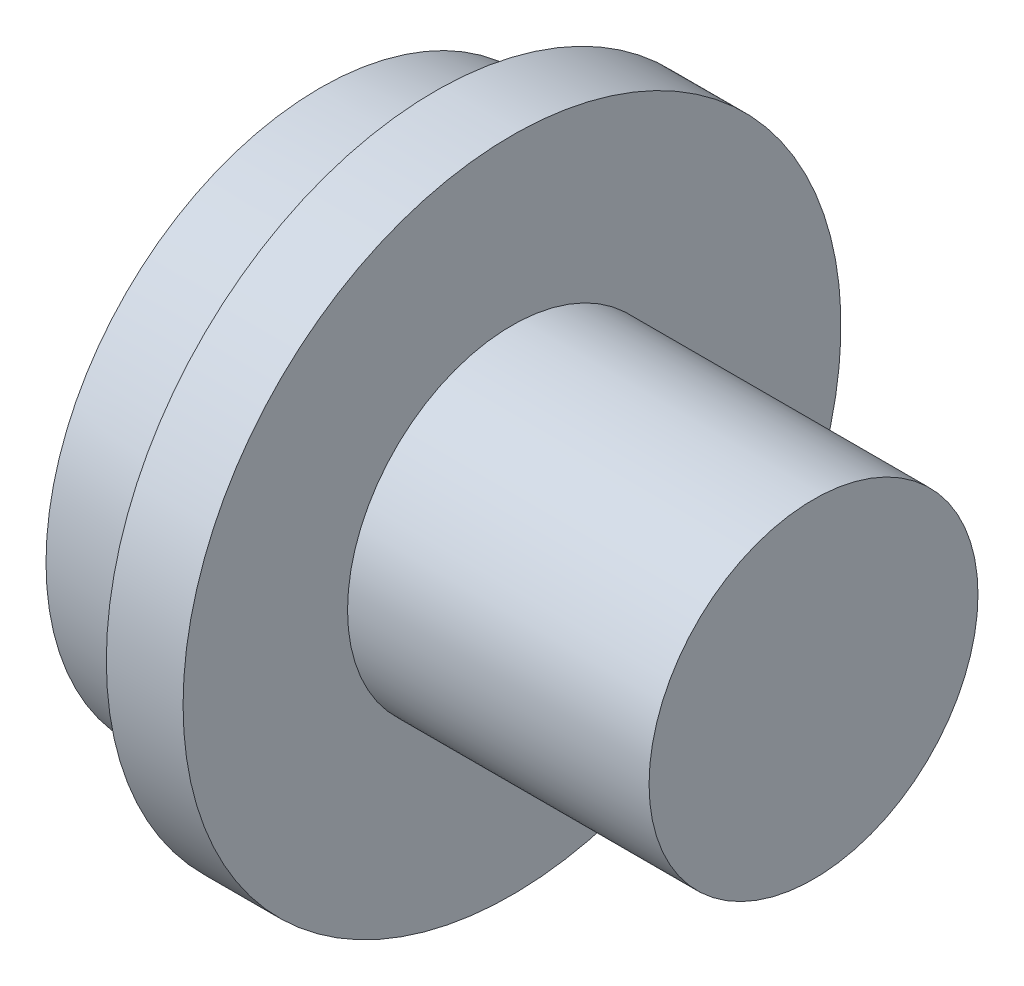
ISO-10303-21;
HEADER;
FILE_DESCRIPTION(('STEP AP214'),'2;1');
FILE_NAME('part.step','',(''),(''),'','','');
FILE_SCHEMA(('AUTOMOTIVE_DESIGN { 1 0 10303 214 1 1 1 1 }'));
ENDSEC;
DATA;
#1=APPLICATION_CONTEXT('core data for automotive mechanical design processes');
#2=APPLICATION_PROTOCOL_DEFINITION('international standard','automotive_design',2000,#1);
#3=PRODUCT_CONTEXT('',#1,'mechanical');
#4=PRODUCT('Part','Part','',(#3));
#5=PRODUCT_RELATED_PRODUCT_CATEGORY('part','',(#4));
#6=PRODUCT_DEFINITION_FORMATION('','',#4);
#7=PRODUCT_DEFINITION_CONTEXT('part definition',#1,'design');
#8=PRODUCT_DEFINITION('design','',#6,#7);
#9=PRODUCT_DEFINITION_SHAPE('','',#8);
#10=(LENGTH_UNIT() NAMED_UNIT(*) SI_UNIT(.MILLI.,.METRE.));
#11=(NAMED_UNIT(*) PLANE_ANGLE_UNIT() SI_UNIT($,.RADIAN.));
#12=(NAMED_UNIT(*) SI_UNIT($,.STERADIAN.) SOLID_ANGLE_UNIT());
#13=UNCERTAINTY_MEASURE_WITH_UNIT(LENGTH_MEASURE(1.E-05),#10,'distance_accuracy_value','');
#14=(GEOMETRIC_REPRESENTATION_CONTEXT(3) GLOBAL_UNCERTAINTY_ASSIGNED_CONTEXT((#13)) GLOBAL_UNIT_ASSIGNED_CONTEXT((#10,
#11,#12)) REPRESENTATION_CONTEXT('',''));
#15=CARTESIAN_POINT('',(0.,0.,0.));
#16=DIRECTION('',(0.,0.,1.));
#17=DIRECTION('',(1.,0.,0.));
#18=AXIS2_PLACEMENT_3D('',#15,#16,#17);
#19=CARTESIAN_POINT('',(0.,30.,0.));
#20=DIRECTION('',(-1.,0.,0.));
#21=DIRECTION('',(0.,0.,1.));
#22=AXIS2_PLACEMENT_3D('',#19,#20,#21);
#23=PLANE('',#22);
#24=CARTESIAN_POINT('',(0.,0.,0.));
#25=DIRECTION('',(-1.,0.,0.));
#26=DIRECTION('',(0.,0.,1.));
#27=AXIS2_PLACEMENT_3D('',#24,#25,#26);
#28=CIRCLE('',#27,30.);
#29=CARTESIAN_POINT('',(0.,0.,30.));
#30=VERTEX_POINT('',#29);
#31=EDGE_CURVE('E10',#30,#30,#28,.T.);
#32=ORIENTED_EDGE('',*,*,#31,.F.);
#33=EDGE_LOOP('',(#32));
#34=FACE_BOUND('',#33,.T.);
#35=ADVANCED_FACE('F29',(#34),#23,.F.);
#36=CARTESIAN_POINT('',(-100.,0.,0.));
#37=DIRECTION('',(-1.,0.,0.));
#38=DIRECTION('',(0.,0.,1.));
#39=AXIS2_PLACEMENT_3D('',#36,#37,#38);
#40=CYLINDRICAL_SURFACE('',#39,30.);
#41=CARTESIAN_POINT('',(-55.,0.,0.));
#42=DIRECTION('',(-1.,0.,0.));
#43=DIRECTION('',(0.,0.,1.));
#44=AXIS2_PLACEMENT_3D('',#41,#42,#43);
#45=CIRCLE('',#44,30.);
#46=CARTESIAN_POINT('',(-55.,0.,30.));
#47=VERTEX_POINT('',#46);
#48=EDGE_CURVE('E35',#47,#47,#45,.T.);
#49=ORIENTED_EDGE('',*,*,#48,.F.);
#50=EDGE_LOOP('',(#49));
#51=FACE_BOUND('',#50,.T.);
#52=ORIENTED_EDGE('',*,*,#31,.T.);
#53=EDGE_LOOP('',(#52));
#54=FACE_BOUND('',#53,.T.);
#55=ADVANCED_FACE('F95',(#51,#54),#40,.T.);
#56=CARTESIAN_POINT('',(-55.,60.,0.));
#57=DIRECTION('',(-1.,0.,0.));
#58=DIRECTION('',(0.,0.,1.));
#59=AXIS2_PLACEMENT_3D('',#56,#57,#58);
#60=PLANE('',#59);
#61=CARTESIAN_POINT('',(-55.,0.,0.));
#62=DIRECTION('',(-1.,0.,0.));
#63=DIRECTION('',(0.,0.,1.));
#64=AXIS2_PLACEMENT_3D('',#61,#62,#63);
#65=CIRCLE('',#64,60.);
#66=CARTESIAN_POINT('',(-55.,0.,60.));
#67=VERTEX_POINT('',#66);
#68=EDGE_CURVE('E39',#67,#67,#65,.T.);
#69=ORIENTED_EDGE('',*,*,#68,.F.);
#70=EDGE_LOOP('',(#69));
#71=FACE_BOUND('',#70,.T.);
#72=ORIENTED_EDGE('',*,*,#48,.T.);
#73=EDGE_LOOP('',(#72));
#74=FACE_BOUND('',#73,.T.);
#75=ADVANCED_FACE('F90',(#71,#74),#60,.F.);
#76=CARTESIAN_POINT('',(-100.,0.,0.));
#77=DIRECTION('',(-1.,0.,0.));
#78=DIRECTION('',(0.,0.,1.));
#79=AXIS2_PLACEMENT_3D('',#76,#77,#78);
#80=CYLINDRICAL_SURFACE('',#79,60.);
#81=CARTESIAN_POINT('',(-69.,0.,0.));
#82=DIRECTION('',(-1.,0.,0.));
#83=DIRECTION('',(0.,0.,1.));
#84=AXIS2_PLACEMENT_3D('',#81,#82,#83);
#85=CIRCLE('',#84,60.);
#86=CARTESIAN_POINT('',(-69.,0.,60.));
#87=VERTEX_POINT('',#86);
#88=EDGE_CURVE('E43',#87,#87,#85,.T.);
#89=ORIENTED_EDGE('',*,*,#88,.F.);
#90=EDGE_LOOP('',(#89));
#91=FACE_BOUND('',#90,.T.);
#92=ORIENTED_EDGE('',*,*,#68,.T.);
#93=EDGE_LOOP('',(#92));
#94=FACE_BOUND('',#93,.T.);
#95=ADVANCED_FACE('F84',(#91,#94),#80,.T.);
#96=CARTESIAN_POINT('',(-69.,60.,0.));
#97=DIRECTION('',(1.,0.,0.));
#98=DIRECTION('',(0.,0.,-1.));
#99=AXIS2_PLACEMENT_3D('',#96,#97,#98);
#100=PLANE('',#99);
#101=CARTESIAN_POINT('',(-69.,0.,0.));
#102=DIRECTION('',(-1.,0.,0.));
#103=DIRECTION('',(0.,0.,1.));
#104=AXIS2_PLACEMENT_3D('',#101,#102,#103);
#105=CIRCLE('',#104,51.5789979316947);
#106=CARTESIAN_POINT('',(-69.,0.,51.5789979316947));
#107=VERTEX_POINT('',#106);
#108=EDGE_CURVE('E48',#107,#107,#105,.T.);
#109=ORIENTED_EDGE('',*,*,#108,.F.);
#110=EDGE_LOOP('',(#109));
#111=FACE_BOUND('',#110,.T.);
#112=ORIENTED_EDGE('',*,*,#88,.T.);
#113=EDGE_LOOP('',(#112));
#114=FACE_BOUND('',#113,.T.);
#115=ADVANCED_FACE('F78',(#111,#114),#100,.F.);
#116=CARTESIAN_POINT('',(-69.,0.,0.));
#117=DIRECTION('',(1.,0.,0.));
#118=DIRECTION('',(0.,0.,-1.));
#119=AXIS2_PLACEMENT_3D('',#116,#117,#118);
#120=CONICAL_SURFACE('',#119,51.5789979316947,0.0750491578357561);
#121=CARTESIAN_POINT('',(-90.,0.,0.));
#122=DIRECTION('',(-1.,0.,0.));
#123=DIRECTION('',(0.,0.,1.));
#124=AXIS2_PLACEMENT_3D('',#121,#122,#123);
#125=CIRCLE('',#124,50.);
#126=CARTESIAN_POINT('',(-90.,0.,50.));
#127=VERTEX_POINT('',#126);
#128=EDGE_CURVE('E51',#127,#127,#125,.T.);
#129=ORIENTED_EDGE('',*,*,#128,.F.);
#130=EDGE_LOOP('',(#129));
#131=FACE_BOUND('',#130,.T.);
#132=ORIENTED_EDGE('',*,*,#108,.T.);
#133=EDGE_LOOP('',(#132));
#134=FACE_BOUND('',#133,.T.);
#135=ADVANCED_FACE('F72',(#131,#134),#120,.T.);
#136=CARTESIAN_POINT('',(-90.,50.,0.));
#137=DIRECTION('',(1.,0.,0.));
#138=DIRECTION('',(0.,0.,-1.));
#139=AXIS2_PLACEMENT_3D('',#136,#137,#138);
#140=PLANE('',#139);
#141=CARTESIAN_POINT('',(-90.,0.,0.));
#142=DIRECTION('',(-1.,0.,0.));
#143=DIRECTION('',(0.,0.,1.));
#144=AXIS2_PLACEMENT_3D('',#141,#142,#143);
#145=CIRCLE('',#144,35.);
#146=CARTESIAN_POINT('',(-90.,0.,35.));
#147=VERTEX_POINT('',#146);
#148=EDGE_CURVE('E54',#147,#147,#145,.T.);
#149=ORIENTED_EDGE('',*,*,#148,.F.);
#150=EDGE_LOOP('',(#149));
#151=FACE_BOUND('',#150,.T.);
#152=ORIENTED_EDGE('',*,*,#128,.T.);
#153=EDGE_LOOP('',(#152));
#154=FACE_BOUND('',#153,.T.);
#155=ADVANCED_FACE('F66',(#151,#154),#140,.F.);
#156=CARTESIAN_POINT('',(-100.,0.,0.));
#157=DIRECTION('',(-1.,0.,0.));
#158=DIRECTION('',(0.,0.,1.));
#159=AXIS2_PLACEMENT_3D('',#156,#157,#158);
#160=CYLINDRICAL_SURFACE('',#159,35.);
#161=CARTESIAN_POINT('',(-100.,0.,0.));
#162=DIRECTION('',(-1.,0.,0.));
#163=DIRECTION('',(0.,0.,1.));
#164=AXIS2_PLACEMENT_3D('',#161,#162,#163);
#165=CIRCLE('',#164,35.);
#166=CARTESIAN_POINT('',(-100.,0.,35.));
#167=VERTEX_POINT('',#166);
#168=EDGE_CURVE('E57',#167,#167,#165,.T.);
#169=ORIENTED_EDGE('',*,*,#168,.F.);
#170=EDGE_LOOP('',(#169));
#171=FACE_BOUND('',#170,.T.);
#172=ORIENTED_EDGE('',*,*,#148,.T.);
#173=EDGE_LOOP('',(#172));
#174=FACE_BOUND('',#173,.T.);
#175=ADVANCED_FACE('F63',(#171,#174),#160,.T.);
#176=CARTESIAN_POINT('',(-100.,35.,0.));
#177=DIRECTION('',(1.,0.,0.));
#178=DIRECTION('',(0.,0.,-1.));
#179=AXIS2_PLACEMENT_3D('',#176,#177,#178);
#180=PLANE('',#179);
#181=ORIENTED_EDGE('',*,*,#168,.T.);
#182=EDGE_LOOP('',(#181));
#183=FACE_BOUND('',#182,.T.);
#184=ADVANCED_FACE('F61',(#183),#180,.F.);
#185=CLOSED_SHELL('',(#35,#55,#75,#95,#115,#135,#155,#175,#184));
#186=MANIFOLD_SOLID_BREP('B2',#185);
#187=ADVANCED_BREP_SHAPE_REPRESENTATION('',(#18,#186),#14);
#188=SHAPE_DEFINITION_REPRESENTATION(#9,#187);
ENDSEC;
END-ISO-10303-21;
